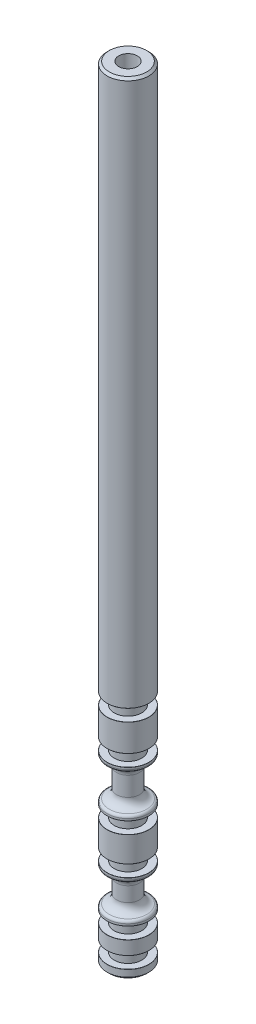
from build123d import *

# Parameters (mm, degrees)
SKETCH1_W                    = 2.295
SKETCH1_H                    = 85.69
FILLET1_R                    = 1
FILLET2_R                    = 0.3
M2_5X0_45_TAPPED_HOLE1_D     = 2.05
M2_5X0_45_TAPPED_HOLE1_DEPTH = 6.35
M2_5X0_45_TAPPED_HOLE1_TIP   = 0.615882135
CHAMFER1_SIZE                = 0.01
CHAMFER2_SIZE                = 0.25


with BuildPart() as part:
    # Sketch1 → Revolve1 (revolve)
    with BuildSketch(Plane.XY, mode=Mode.PRIVATE) as revolve1_sk:
        with Locations((1.1475, 42.845)):
            Rectangle(SKETCH1_W, SKETCH1_H)
    revolve(revolve1_sk.sketch.rotate(Axis((0, -5.946636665, 0), (0, 1, 0)), 90), axis=Axis((0, -5.946636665, 0), (0, 1, 0)))

    # Sketch2 → Cut-Revolve3 (revolve, cut)
    with BuildSketch(Plane.XY, mode=Mode.PRIVATE) as cut_revolve3_sk:
        Polygon((1.51, 21.5), (2.538451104, 21.5), (2.538451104, 24.5), (1.51, 24.5), (1.51, 25.8), (3.819489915, 25.8), (3.819489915, 1), (1.51, 1), (1.51, 2.3), (2.538451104, 2.3), (2.538451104, 3.8), (1.51, 3.8), (1.51, 5.1), (2.538451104, 5.1), (2.538451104, 5.6), (1.25, 5.6), (1.25, 9.2), (2.538451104, 9.2), (2.538451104, 9.7), (1.51, 9.7), (1.51, 11), (2.538451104, 11), (2.538451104, 13.8), (1.51, 13.8), (1.51, 15.1), (2.538451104, 15.1), (2.538451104, 15.6), (1.25, 15.6), (1.25, 19.7), (2.538451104, 19.7), (2.538451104, 20.2), (1.51, 20.2), align=None)
    revolve(cut_revolve3_sk.sketch.rotate(Axis((0, 86.365687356, 0), (0, -1, 0)), 270), axis=Axis((0, 86.365687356, 0), (0, -1, 0)), mode=Mode.SUBTRACT)

    # Fillet1
    fillet1_edges = [part.edges().sort_by_distance(p)[0] for p in [
        (0, 9.2, 1.25),
        (0, 5.6, 1.25),
        (0, 19.7, 1.25),
        (0, 15.6, 1.25),
    ]]
    fillet(fillet1_edges, radius=FILLET1_R)

    # Fillet2
    fillet2_edges = [part.edges().sort_by_distance(p)[0] for p in [
        (0, 19.7, 2.295),
        (0, 15.6, 2.295),
        (0, 9.2, 2.295),
        (0, 5.6, 2.295),
    ]]
    fillet(fillet2_edges, radius=FILLET2_R)

    # M2.5x0.45 Tapped Hole1
    with Locations(Plane(origin=(0, 85.69, 0), x_dir=(1, 0, 0), z_dir=(0, 1, 0))):
        with Locations((0, 0)):
            Hole(M2_5X0_45_TAPPED_HOLE1_D / 2, depth=M2_5X0_45_TAPPED_HOLE1_DEPTH)
            with Locations((0, 0, -(M2_5X0_45_TAPPED_HOLE1_DEPTH + M2_5X0_45_TAPPED_HOLE1_TIP / 2))):  # 118° drill point
                Cone(0, M2_5X0_45_TAPPED_HOLE1_D / 2, M2_5X0_45_TAPPED_HOLE1_TIP, mode=Mode.SUBTRACT)

    # Chamfer1
    chamfer1_edges = [part.edges().sort_by_distance(p)[0] for p in [
        (0, 15.1, 2.295),
        (0, 13.8, 2.295),
        (0, 11, 2.295),
        (0, 9.7, 2.295),
        (0, 5.1, 2.295),
        (0, 3.8, 2.295),
        (0, 2.3, 2.295),
        (0, 1, 2.295),
        (0, 25.8, 2.295),
        (0, 24.5, 2.295),
        (0, 21.5, 2.295),
        (0, 20.2, 2.295),
    ]]
    chamfer(chamfer1_edges, length=CHAMFER1_SIZE)

    # Chamfer2
    chamfer2_edges = [part.edges().sort_by_distance(p)[0] for p in [
        (0, 0, 2.295),
        (0, 85.69, 2.295),
    ]]
    chamfer(chamfer2_edges, length=CHAMFER2_SIZE)


solid = part.part
